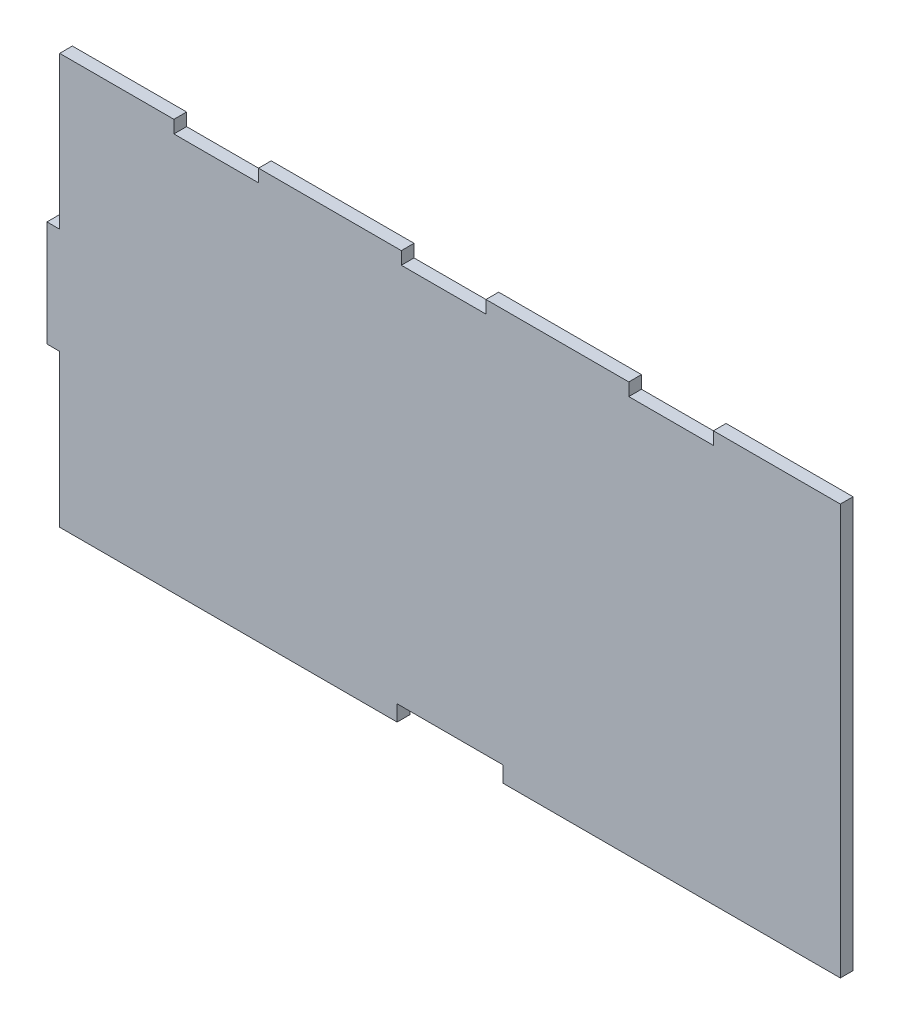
ISO-10303-21;
HEADER;
FILE_DESCRIPTION(('STEP AP214'),'2;1');
FILE_NAME('part.step','',(''),(''),'','','');
FILE_SCHEMA(('AUTOMOTIVE_DESIGN { 1 0 10303 214 1 1 1 1 }'));
ENDSEC;
DATA;
#1=APPLICATION_CONTEXT('core data for automotive mechanical design processes');
#2=APPLICATION_PROTOCOL_DEFINITION('international standard','automotive_design',2000,#1);
#3=PRODUCT_CONTEXT('',#1,'mechanical');
#4=PRODUCT('Part','Part','',(#3));
#5=PRODUCT_RELATED_PRODUCT_CATEGORY('part','',(#4));
#6=PRODUCT_DEFINITION_FORMATION('','',#4);
#7=PRODUCT_DEFINITION_CONTEXT('part definition',#1,'design');
#8=PRODUCT_DEFINITION('design','',#6,#7);
#9=PRODUCT_DEFINITION_SHAPE('','',#8);
#10=(LENGTH_UNIT() NAMED_UNIT(*) SI_UNIT(.MILLI.,.METRE.));
#11=(NAMED_UNIT(*) PLANE_ANGLE_UNIT() SI_UNIT($,.RADIAN.));
#12=(NAMED_UNIT(*) SI_UNIT($,.STERADIAN.) SOLID_ANGLE_UNIT());
#13=UNCERTAINTY_MEASURE_WITH_UNIT(LENGTH_MEASURE(1.E-05),#10,'distance_accuracy_value','');
#14=(GEOMETRIC_REPRESENTATION_CONTEXT(3) GLOBAL_UNCERTAINTY_ASSIGNED_CONTEXT((#13)) GLOBAL_UNIT_ASSIGNED_CONTEXT((#10,
#11,#12)) REPRESENTATION_CONTEXT('',''));
#15=CARTESIAN_POINT('',(0.,0.,0.));
#16=DIRECTION('',(0.,0.,1.));
#17=DIRECTION('',(1.,0.,0.));
#18=AXIS2_PLACEMENT_3D('',#15,#16,#17);
#19=CARTESIAN_POINT('',(-369.,50.,12.));
#20=DIRECTION('',(1.,0.,0.));
#21=DIRECTION('',(0.,0.,-1.));
#22=AXIS2_PLACEMENT_3D('',#19,#20,#21);
#23=PLANE('',#22);
#24=DIRECTION('',(0.,-1.,0.));
#25=VECTOR('',#24,1.);
#26=CARTESIAN_POINT('',(-369.,50.,0.));
#27=LINE('',#26,#25);
#28=CARTESIAN_POINT('',(-369.,194.,0.));
#29=VERTEX_POINT('',#28);
#30=CARTESIAN_POINT('',(-369.,50.,0.));
#31=VERTEX_POINT('',#30);
#32=EDGE_CURVE('E231',#29,#31,#27,.T.);
#33=ORIENTED_EDGE('',*,*,#32,.T.);
#34=DIRECTION('',(0.,0.,-1.));
#35=VECTOR('',#34,1.);
#36=CARTESIAN_POINT('',(-369.,50.,12.));
#37=LINE('',#36,#35);
#38=CARTESIAN_POINT('',(-369.,50.,12.));
#39=VERTEX_POINT('',#38);
#40=EDGE_CURVE('E11',#39,#31,#37,.T.);
#41=ORIENTED_EDGE('',*,*,#40,.F.);
#42=DIRECTION('',(0.,-1.,0.));
#43=VECTOR('',#42,1.);
#44=CARTESIAN_POINT('',(-369.,50.,12.));
#45=LINE('',#44,#43);
#46=CARTESIAN_POINT('',(-369.,194.,12.));
#47=VERTEX_POINT('',#46);
#48=EDGE_CURVE('E280',#47,#39,#45,.T.);
#49=ORIENTED_EDGE('',*,*,#48,.F.);
#50=DIRECTION('',(0.,0.,-1.));
#51=VECTOR('',#50,1.);
#52=CARTESIAN_POINT('',(-369.,194.,12.));
#53=LINE('',#52,#51);
#54=EDGE_CURVE('E230',#47,#29,#53,.T.);
#55=ORIENTED_EDGE('',*,*,#54,.T.);
#56=EDGE_LOOP('',(#33,#41,#49,#55));
#57=FACE_BOUND('',#56,.T.);
#58=ADVANCED_FACE('F39',(#57),#23,.F.);
#59=CARTESIAN_POINT('',(-369.,50.,12.));
#60=DIRECTION('',(0.,-1.,0.));
#61=DIRECTION('',(1.,0.,0.));
#62=AXIS2_PLACEMENT_3D('',#59,#60,#61);
#63=PLANE('',#62);
#64=DIRECTION('',(-1.,0.,0.));
#65=VECTOR('',#64,1.);
#66=CARTESIAN_POINT('',(-369.,50.,0.));
#67=LINE('',#66,#65);
#68=CARTESIAN_POINT('',(-381.,50.,0.));
#69=VERTEX_POINT('',#68);
#70=EDGE_CURVE('E233',#31,#69,#67,.T.);
#71=ORIENTED_EDGE('',*,*,#70,.T.);
#72=DIRECTION('',(0.,0.,-1.));
#73=VECTOR('',#72,1.);
#74=CARTESIAN_POINT('',(-381.,50.,12.));
#75=LINE('',#74,#73);
#76=CARTESIAN_POINT('',(-381.,50.,12.));
#77=VERTEX_POINT('',#76);
#78=EDGE_CURVE('E50',#77,#69,#75,.T.);
#79=ORIENTED_EDGE('',*,*,#78,.F.);
#80=DIRECTION('',(-1.,0.,0.));
#81=VECTOR('',#80,1.);
#82=CARTESIAN_POINT('',(-369.,50.,12.));
#83=LINE('',#82,#81);
#84=EDGE_CURVE('E147',#39,#77,#83,.T.);
#85=ORIENTED_EDGE('',*,*,#84,.F.);
#86=ORIENTED_EDGE('',*,*,#40,.T.);
#87=EDGE_LOOP('',(#71,#79,#85,#86));
#88=FACE_BOUND('',#87,.T.);
#89=ADVANCED_FACE('F414',(#88),#63,.F.);
#90=CARTESIAN_POINT('',(-381.,50.,12.));
#91=DIRECTION('',(1.,0.,0.));
#92=DIRECTION('',(0.,0.,-1.));
#93=AXIS2_PLACEMENT_3D('',#90,#91,#92);
#94=PLANE('',#93);
#95=DIRECTION('',(0.,-1.,0.));
#96=VECTOR('',#95,1.);
#97=CARTESIAN_POINT('',(-381.,50.,0.));
#98=LINE('',#97,#96);
#99=CARTESIAN_POINT('',(-381.,-50.,0.));
#100=VERTEX_POINT('',#99);
#101=EDGE_CURVE('E237',#69,#100,#98,.T.);
#102=ORIENTED_EDGE('',*,*,#101,.T.);
#103=DIRECTION('',(0.,0.,-1.));
#104=VECTOR('',#103,1.);
#105=CARTESIAN_POINT('',(-381.,-50.,12.));
#106=LINE('',#105,#104);
#107=CARTESIAN_POINT('',(-381.,-50.,12.));
#108=VERTEX_POINT('',#107);
#109=EDGE_CURVE('E334',#108,#100,#106,.T.);
#110=ORIENTED_EDGE('',*,*,#109,.F.);
#111=DIRECTION('',(0.,-1.,0.));
#112=VECTOR('',#111,1.);
#113=CARTESIAN_POINT('',(-381.,50.,12.));
#114=LINE('',#113,#112);
#115=EDGE_CURVE('E338',#77,#108,#114,.T.);
#116=ORIENTED_EDGE('',*,*,#115,.F.);
#117=ORIENTED_EDGE('',*,*,#78,.T.);
#118=EDGE_LOOP('',(#102,#110,#116,#117));
#119=FACE_BOUND('',#118,.T.);
#120=ADVANCED_FACE('F336',(#119),#94,.F.);
#121=CARTESIAN_POINT('',(-369.,-50.,12.));
#122=DIRECTION('',(0.,1.,0.));
#123=DIRECTION('',(0.,0.,1.));
#124=AXIS2_PLACEMENT_3D('',#121,#122,#123);
#125=PLANE('',#124);
#126=DIRECTION('',(1.,0.,0.));
#127=VECTOR('',#126,1.);
#128=CARTESIAN_POINT('',(-369.,-50.,0.));
#129=LINE('',#128,#127);
#130=CARTESIAN_POINT('',(-369.,-50.,0.));
#131=VERTEX_POINT('',#130);
#132=EDGE_CURVE('E239',#100,#131,#129,.T.);
#133=ORIENTED_EDGE('',*,*,#132,.T.);
#134=DIRECTION('',(0.,0.,-1.));
#135=VECTOR('',#134,1.);
#136=CARTESIAN_POINT('',(-369.,-50.,12.));
#137=LINE('',#136,#135);
#138=CARTESIAN_POINT('',(-369.,-50.,12.));
#139=VERTEX_POINT('',#138);
#140=EDGE_CURVE('E326',#139,#131,#137,.T.);
#141=ORIENTED_EDGE('',*,*,#140,.F.);
#142=DIRECTION('',(1.,0.,0.));
#143=VECTOR('',#142,1.);
#144=CARTESIAN_POINT('',(-369.,-50.,12.));
#145=LINE('',#144,#143);
#146=EDGE_CURVE('E358',#108,#139,#145,.T.);
#147=ORIENTED_EDGE('',*,*,#146,.F.);
#148=ORIENTED_EDGE('',*,*,#109,.T.);
#149=EDGE_LOOP('',(#133,#141,#147,#148));
#150=FACE_BOUND('',#149,.T.);
#151=ADVANCED_FACE('F350',(#150),#125,.F.);
#152=CARTESIAN_POINT('',(-369.,-194.,12.));
#153=DIRECTION('',(1.,0.,0.));
#154=DIRECTION('',(0.,0.,-1.));
#155=AXIS2_PLACEMENT_3D('',#152,#153,#154);
#156=PLANE('',#155);
#157=DIRECTION('',(0.,-1.,0.));
#158=VECTOR('',#157,1.);
#159=CARTESIAN_POINT('',(-369.,-194.,0.));
#160=LINE('',#159,#158);
#161=CARTESIAN_POINT('',(-369.,-194.,0.));
#162=VERTEX_POINT('',#161);
#163=EDGE_CURVE('E238',#131,#162,#160,.T.);
#164=ORIENTED_EDGE('',*,*,#163,.T.);
#165=DIRECTION('',(0.,0.,-1.));
#166=VECTOR('',#165,1.);
#167=CARTESIAN_POINT('',(-369.,-194.,12.));
#168=LINE('',#167,#166);
#169=CARTESIAN_POINT('',(-369.,-194.,12.));
#170=VERTEX_POINT('',#169);
#171=EDGE_CURVE('E327',#170,#162,#168,.T.);
#172=ORIENTED_EDGE('',*,*,#171,.F.);
#173=DIRECTION('',(0.,-1.,0.));
#174=VECTOR('',#173,1.);
#175=CARTESIAN_POINT('',(-369.,-194.,12.));
#176=LINE('',#175,#174);
#177=EDGE_CURVE('E352',#139,#170,#176,.T.);
#178=ORIENTED_EDGE('',*,*,#177,.F.);
#179=ORIENTED_EDGE('',*,*,#140,.T.);
#180=EDGE_LOOP('',(#164,#172,#178,#179));
#181=FACE_BOUND('',#180,.T.);
#182=ADVANCED_FACE('F351',(#181),#156,.F.);
#183=CARTESIAN_POINT('',(-50.0000000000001,-194.,12.));
#184=DIRECTION('',(0.,1.,0.));
#185=DIRECTION('',(-1.,0.,0.));
#186=AXIS2_PLACEMENT_3D('',#183,#184,#185);
#187=PLANE('',#186);
#188=DIRECTION('',(1.,0.,0.));
#189=VECTOR('',#188,1.);
#190=CARTESIAN_POINT('',(-50.0000000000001,-194.,0.));
#191=LINE('',#190,#189);
#192=CARTESIAN_POINT('',(-50.0000000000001,-194.,0.));
#193=VERTEX_POINT('',#192);
#194=EDGE_CURVE('E244',#162,#193,#191,.T.);
#195=ORIENTED_EDGE('',*,*,#194,.T.);
#196=DIRECTION('',(0.,0.,-1.));
#197=VECTOR('',#196,1.);
#198=CARTESIAN_POINT('',(-50.0000000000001,-194.,12.));
#199=LINE('',#198,#197);
#200=CARTESIAN_POINT('',(-50.0000000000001,-194.,12.));
#201=VERTEX_POINT('',#200);
#202=EDGE_CURVE('E322',#201,#193,#199,.T.);
#203=ORIENTED_EDGE('',*,*,#202,.F.);
#204=DIRECTION('',(1.,0.,0.));
#205=VECTOR('',#204,1.);
#206=CARTESIAN_POINT('',(-50.0000000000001,-194.,12.));
#207=LINE('',#206,#205);
#208=EDGE_CURVE('E360',#170,#201,#207,.T.);
#209=ORIENTED_EDGE('',*,*,#208,.F.);
#210=ORIENTED_EDGE('',*,*,#171,.T.);
#211=EDGE_LOOP('',(#195,#203,#209,#210));
#212=FACE_BOUND('',#211,.T.);
#213=ADVANCED_FACE('F426',(#212),#187,.F.);
#214=CARTESIAN_POINT('',(-50.0000000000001,-194.,12.));
#215=DIRECTION('',(-1.,0.,0.));
#216=DIRECTION('',(0.,-1.,0.));
#217=AXIS2_PLACEMENT_3D('',#214,#215,#216);
#218=PLANE('',#217);
#219=DIRECTION('',(0.,1.,0.));
#220=VECTOR('',#219,1.);
#221=CARTESIAN_POINT('',(-50.0000000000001,-194.,0.));
#222=LINE('',#221,#220);
#223=CARTESIAN_POINT('',(-50.,-179.,0.));
#224=VERTEX_POINT('',#223);
#225=EDGE_CURVE('E241',#193,#224,#222,.T.);
#226=ORIENTED_EDGE('',*,*,#225,.T.);
#227=DIRECTION('',(0.,0.,-1.));
#228=VECTOR('',#227,1.);
#229=CARTESIAN_POINT('',(-50.,-179.,12.));
#230=LINE('',#229,#228);
#231=CARTESIAN_POINT('',(-50.,-179.,12.));
#232=VERTEX_POINT('',#231);
#233=EDGE_CURVE('E319',#232,#224,#230,.T.);
#234=ORIENTED_EDGE('',*,*,#233,.F.);
#235=DIRECTION('',(0.,1.,0.));
#236=VECTOR('',#235,1.);
#237=CARTESIAN_POINT('',(-50.0000000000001,-194.,12.));
#238=LINE('',#237,#236);
#239=EDGE_CURVE('E359',#201,#232,#238,.T.);
#240=ORIENTED_EDGE('',*,*,#239,.F.);
#241=ORIENTED_EDGE('',*,*,#202,.T.);
#242=EDGE_LOOP('',(#226,#234,#240,#241));
#243=FACE_BOUND('',#242,.T.);
#244=ADVANCED_FACE('F432',(#243),#218,.F.);
#245=CARTESIAN_POINT('',(50.,-179.,12.));
#246=DIRECTION('',(0.,1.,0.));
#247=DIRECTION('',(0.,0.,1.));
#248=AXIS2_PLACEMENT_3D('',#245,#246,#247);
#249=PLANE('',#248);
#250=DIRECTION('',(1.,0.,0.));
#251=VECTOR('',#250,1.);
#252=CARTESIAN_POINT('',(50.,-179.,0.));
#253=LINE('',#252,#251);
#254=CARTESIAN_POINT('',(50.,-179.,0.));
#255=VERTEX_POINT('',#254);
#256=EDGE_CURVE('E247',#224,#255,#253,.T.);
#257=ORIENTED_EDGE('',*,*,#256,.T.);
#258=DIRECTION('',(0.,0.,-1.));
#259=VECTOR('',#258,1.);
#260=CARTESIAN_POINT('',(50.,-179.,12.));
#261=LINE('',#260,#259);
#262=CARTESIAN_POINT('',(50.,-179.,12.));
#263=VERTEX_POINT('',#262);
#264=EDGE_CURVE('E320',#263,#255,#261,.T.);
#265=ORIENTED_EDGE('',*,*,#264,.F.);
#266=DIRECTION('',(1.,0.,0.));
#267=VECTOR('',#266,1.);
#268=CARTESIAN_POINT('',(50.,-179.,12.));
#269=LINE('',#268,#267);
#270=EDGE_CURVE('E366',#232,#263,#269,.T.);
#271=ORIENTED_EDGE('',*,*,#270,.F.);
#272=ORIENTED_EDGE('',*,*,#233,.T.);
#273=EDGE_LOOP('',(#257,#265,#271,#272));
#274=FACE_BOUND('',#273,.T.);
#275=ADVANCED_FACE('F433',(#274),#249,.F.);
#276=CARTESIAN_POINT('',(49.9999999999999,-194.,12.));
#277=DIRECTION('',(1.,0.,0.));
#278=DIRECTION('',(0.,1.,0.));
#279=AXIS2_PLACEMENT_3D('',#276,#277,#278);
#280=PLANE('',#279);
#281=DIRECTION('',(0.,-1.,0.));
#282=VECTOR('',#281,1.);
#283=CARTESIAN_POINT('',(49.9999999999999,-194.,0.));
#284=LINE('',#283,#282);
#285=CARTESIAN_POINT('',(49.9999999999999,-194.,0.));
#286=VERTEX_POINT('',#285);
#287=EDGE_CURVE('E246',#255,#286,#284,.T.);
#288=ORIENTED_EDGE('',*,*,#287,.T.);
#289=DIRECTION('',(0.,0.,-1.));
#290=VECTOR('',#289,1.);
#291=CARTESIAN_POINT('',(49.9999999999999,-194.,12.));
#292=LINE('',#291,#290);
#293=CARTESIAN_POINT('',(49.9999999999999,-194.,12.));
#294=VERTEX_POINT('',#293);
#295=EDGE_CURVE('E312',#294,#286,#292,.T.);
#296=ORIENTED_EDGE('',*,*,#295,.F.);
#297=DIRECTION('',(0.,-1.,0.));
#298=VECTOR('',#297,1.);
#299=CARTESIAN_POINT('',(49.9999999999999,-194.,12.));
#300=LINE('',#299,#298);
#301=EDGE_CURVE('E367',#263,#294,#300,.T.);
#302=ORIENTED_EDGE('',*,*,#301,.F.);
#303=ORIENTED_EDGE('',*,*,#264,.T.);
#304=EDGE_LOOP('',(#288,#296,#302,#303));
#305=FACE_BOUND('',#304,.T.);
#306=ADVANCED_FACE('F440',(#305),#280,.F.);
#307=CARTESIAN_POINT('',(369.,-194.,12.));
#308=DIRECTION('',(0.,1.,0.));
#309=DIRECTION('',(-1.,0.,0.));
#310=AXIS2_PLACEMENT_3D('',#307,#308,#309);
#311=PLANE('',#310);
#312=DIRECTION('',(1.,0.,0.));
#313=VECTOR('',#312,1.);
#314=CARTESIAN_POINT('',(369.,-194.,0.));
#315=LINE('',#314,#313);
#316=CARTESIAN_POINT('',(369.,-194.,0.));
#317=VERTEX_POINT('',#316);
#318=EDGE_CURVE('E248',#286,#317,#315,.T.);
#319=ORIENTED_EDGE('',*,*,#318,.T.);
#320=DIRECTION('',(0.,0.,-1.));
#321=VECTOR('',#320,1.);
#322=CARTESIAN_POINT('',(369.,-194.,12.));
#323=LINE('',#322,#321);
#324=CARTESIAN_POINT('',(369.,-194.,12.));
#325=VERTEX_POINT('',#324);
#326=EDGE_CURVE('E311',#325,#317,#323,.T.);
#327=ORIENTED_EDGE('',*,*,#326,.F.);
#328=DIRECTION('',(1.,0.,0.));
#329=VECTOR('',#328,1.);
#330=CARTESIAN_POINT('',(369.,-194.,12.));
#331=LINE('',#330,#329);
#332=EDGE_CURVE('E369',#294,#325,#331,.T.);
#333=ORIENTED_EDGE('',*,*,#332,.F.);
#334=ORIENTED_EDGE('',*,*,#295,.T.);
#335=EDGE_LOOP('',(#319,#327,#333,#334));
#336=FACE_BOUND('',#335,.T.);
#337=ADVANCED_FACE('F441',(#336),#311,.F.);
#338=CARTESIAN_POINT('',(369.,-194.,12.));
#339=DIRECTION('',(-1.,0.,0.));
#340=DIRECTION('',(0.,0.,1.));
#341=AXIS2_PLACEMENT_3D('',#338,#339,#340);
#342=PLANE('',#341);
#343=DIRECTION('',(0.,1.,0.));
#344=VECTOR('',#343,1.);
#345=CARTESIAN_POINT('',(369.,-194.,0.));
#346=LINE('',#345,#344);
#347=CARTESIAN_POINT('',(369.,194.,0.));
#348=VERTEX_POINT('',#347);
#349=EDGE_CURVE('E254',#317,#348,#346,.T.);
#350=ORIENTED_EDGE('',*,*,#349,.T.);
#351=DIRECTION('',(0.,0.,-1.));
#352=VECTOR('',#351,1.);
#353=CARTESIAN_POINT('',(369.,194.,12.));
#354=LINE('',#353,#352);
#355=CARTESIAN_POINT('',(369.,194.,12.));
#356=VERTEX_POINT('',#355);
#357=EDGE_CURVE('E306',#356,#348,#354,.T.);
#358=ORIENTED_EDGE('',*,*,#357,.F.);
#359=DIRECTION('',(0.,1.,0.));
#360=VECTOR('',#359,1.);
#361=CARTESIAN_POINT('',(369.,-194.,12.));
#362=LINE('',#361,#360);
#363=EDGE_CURVE('E375',#325,#356,#362,.T.);
#364=ORIENTED_EDGE('',*,*,#363,.F.);
#365=ORIENTED_EDGE('',*,*,#326,.T.);
#366=EDGE_LOOP('',(#350,#358,#364,#365));
#367=FACE_BOUND('',#366,.T.);
#368=ADVANCED_FACE('F450',(#367),#342,.F.);
#369=CARTESIAN_POINT('',(369.,194.,12.));
#370=DIRECTION('',(0.,-1.,0.));
#371=DIRECTION('',(1.,0.,0.));
#372=AXIS2_PLACEMENT_3D('',#369,#370,#371);
#373=PLANE('',#372);
#374=DIRECTION('',(-1.,0.,0.));
#375=VECTOR('',#374,1.);
#376=CARTESIAN_POINT('',(369.,194.,0.));
#377=LINE('',#376,#375);
#378=CARTESIAN_POINT('',(249.,194.,0.));
#379=VERTEX_POINT('',#378);
#380=EDGE_CURVE('E251',#348,#379,#377,.T.);
#381=ORIENTED_EDGE('',*,*,#380,.T.);
#382=DIRECTION('',(0.,0.,-1.));
#383=VECTOR('',#382,1.);
#384=CARTESIAN_POINT('',(249.,194.,12.));
#385=LINE('',#384,#383);
#386=CARTESIAN_POINT('',(249.,194.,12.));
#387=VERTEX_POINT('',#386);
#388=EDGE_CURVE('E304',#387,#379,#385,.T.);
#389=ORIENTED_EDGE('',*,*,#388,.F.);
#390=DIRECTION('',(-1.,0.,0.));
#391=VECTOR('',#390,1.);
#392=CARTESIAN_POINT('',(369.,194.,12.));
#393=LINE('',#392,#391);
#394=EDGE_CURVE('E371',#356,#387,#393,.T.);
#395=ORIENTED_EDGE('',*,*,#394,.F.);
#396=ORIENTED_EDGE('',*,*,#357,.T.);
#397=EDGE_LOOP('',(#381,#389,#395,#396));
#398=FACE_BOUND('',#397,.T.);
#399=ADVANCED_FACE('F451',(#398),#373,.F.);
#400=CARTESIAN_POINT('',(249.,194.,12.));
#401=DIRECTION('',(1.,0.,0.));
#402=DIRECTION('',(0.,1.,0.));
#403=AXIS2_PLACEMENT_3D('',#400,#401,#402);
#404=PLANE('',#403);
#405=DIRECTION('',(0.,-1.,0.));
#406=VECTOR('',#405,1.);
#407=CARTESIAN_POINT('',(249.,194.,0.));
#408=LINE('',#407,#406);
#409=CARTESIAN_POINT('',(249.,182.,0.));
#410=VERTEX_POINT('',#409);
#411=EDGE_CURVE('E258',#379,#410,#408,.T.);
#412=ORIENTED_EDGE('',*,*,#411,.T.);
#413=DIRECTION('',(0.,0.,-1.));
#414=VECTOR('',#413,1.);
#415=CARTESIAN_POINT('',(249.,182.,12.));
#416=LINE('',#415,#414);
#417=CARTESIAN_POINT('',(249.,182.,12.));
#418=VERTEX_POINT('',#417);
#419=EDGE_CURVE('E302',#418,#410,#416,.T.);
#420=ORIENTED_EDGE('',*,*,#419,.F.);
#421=DIRECTION('',(0.,-1.,0.));
#422=VECTOR('',#421,1.);
#423=CARTESIAN_POINT('',(249.,194.,12.));
#424=LINE('',#423,#422);
#425=EDGE_CURVE('E377',#387,#418,#424,.T.);
#426=ORIENTED_EDGE('',*,*,#425,.F.);
#427=ORIENTED_EDGE('',*,*,#388,.T.);
#428=EDGE_LOOP('',(#412,#420,#426,#427));
#429=FACE_BOUND('',#428,.T.);
#430=ADVANCED_FACE('F454',(#429),#404,.F.);
#431=CARTESIAN_POINT('',(169.,182.,12.));
#432=DIRECTION('',(0.,-1.,0.));
#433=DIRECTION('',(0.,0.,-1.));
#434=AXIS2_PLACEMENT_3D('',#431,#432,#433);
#435=PLANE('',#434);
#436=DIRECTION('',(-1.,0.,0.));
#437=VECTOR('',#436,1.);
#438=CARTESIAN_POINT('',(169.,182.,0.));
#439=LINE('',#438,#437);
#440=CARTESIAN_POINT('',(169.,182.,0.));
#441=VERTEX_POINT('',#440);
#442=EDGE_CURVE('E256',#410,#441,#439,.T.);
#443=ORIENTED_EDGE('',*,*,#442,.T.);
#444=DIRECTION('',(0.,0.,-1.));
#445=VECTOR('',#444,1.);
#446=CARTESIAN_POINT('',(169.,182.,12.));
#447=LINE('',#446,#445);
#448=CARTESIAN_POINT('',(169.,182.,12.));
#449=VERTEX_POINT('',#448);
#450=EDGE_CURVE('E296',#449,#441,#447,.T.);
#451=ORIENTED_EDGE('',*,*,#450,.F.);
#452=DIRECTION('',(-1.,0.,0.));
#453=VECTOR('',#452,1.);
#454=CARTESIAN_POINT('',(169.,182.,12.));
#455=LINE('',#454,#453);
#456=EDGE_CURVE('E380',#418,#449,#455,.T.);
#457=ORIENTED_EDGE('',*,*,#456,.F.);
#458=ORIENTED_EDGE('',*,*,#419,.T.);
#459=EDGE_LOOP('',(#443,#451,#457,#458));
#460=FACE_BOUND('',#459,.T.);
#461=ADVANCED_FACE('F458',(#460),#435,.F.);
#462=CARTESIAN_POINT('',(169.,194.,12.));
#463=DIRECTION('',(-1.,0.,0.));
#464=DIRECTION('',(0.,0.,1.));
#465=AXIS2_PLACEMENT_3D('',#462,#463,#464);
#466=PLANE('',#465);
#467=DIRECTION('',(0.,1.,0.));
#468=VECTOR('',#467,1.);
#469=CARTESIAN_POINT('',(169.,194.,0.));
#470=LINE('',#469,#468);
#471=CARTESIAN_POINT('',(169.,194.,0.));
#472=VERTEX_POINT('',#471);
#473=EDGE_CURVE('E259',#441,#472,#470,.T.);
#474=ORIENTED_EDGE('',*,*,#473,.T.);
#475=DIRECTION('',(0.,0.,-1.));
#476=VECTOR('',#475,1.);
#477=CARTESIAN_POINT('',(169.,194.,12.));
#478=LINE('',#477,#476);
#479=CARTESIAN_POINT('',(169.,194.,12.));
#480=VERTEX_POINT('',#479);
#481=EDGE_CURVE('E297',#480,#472,#478,.T.);
#482=ORIENTED_EDGE('',*,*,#481,.F.);
#483=DIRECTION('',(0.,1.,0.));
#484=VECTOR('',#483,1.);
#485=CARTESIAN_POINT('',(169.,194.,12.));
#486=LINE('',#485,#484);
#487=EDGE_CURVE('E378',#449,#480,#486,.T.);
#488=ORIENTED_EDGE('',*,*,#487,.F.);
#489=ORIENTED_EDGE('',*,*,#450,.T.);
#490=EDGE_LOOP('',(#474,#482,#488,#489));
#491=FACE_BOUND('',#490,.T.);
#492=ADVANCED_FACE('F464',(#491),#466,.F.);
#493=CARTESIAN_POINT('',(169.,194.,12.));
#494=DIRECTION('',(0.,-1.,0.));
#495=DIRECTION('',(1.,0.,0.));
#496=AXIS2_PLACEMENT_3D('',#493,#494,#495);
#497=PLANE('',#496);
#498=DIRECTION('',(-1.,0.,0.));
#499=VECTOR('',#498,1.);
#500=CARTESIAN_POINT('',(169.,194.,0.));
#501=LINE('',#500,#499);
#502=CARTESIAN_POINT('',(33.9999999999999,194.,0.));
#503=VERTEX_POINT('',#502);
#504=EDGE_CURVE('E265',#472,#503,#501,.T.);
#505=ORIENTED_EDGE('',*,*,#504,.T.);
#506=DIRECTION('',(0.,0.,-1.));
#507=VECTOR('',#506,1.);
#508=CARTESIAN_POINT('',(33.9999999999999,194.,12.));
#509=LINE('',#508,#507);
#510=CARTESIAN_POINT('',(33.9999999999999,194.,12.));
#511=VERTEX_POINT('',#510);
#512=EDGE_CURVE('E291',#511,#503,#509,.T.);
#513=ORIENTED_EDGE('',*,*,#512,.F.);
#514=DIRECTION('',(-1.,0.,0.));
#515=VECTOR('',#514,1.);
#516=CARTESIAN_POINT('',(169.,194.,12.));
#517=LINE('',#516,#515);
#518=EDGE_CURVE('E385',#480,#511,#517,.T.);
#519=ORIENTED_EDGE('',*,*,#518,.F.);
#520=ORIENTED_EDGE('',*,*,#481,.T.);
#521=EDGE_LOOP('',(#505,#513,#519,#520));
#522=FACE_BOUND('',#521,.T.);
#523=ADVANCED_FACE('F469',(#522),#497,.F.);
#524=CARTESIAN_POINT('',(33.9999999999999,194.,12.));
#525=DIRECTION('',(1.,0.,0.));
#526=DIRECTION('',(0.,0.,-1.));
#527=AXIS2_PLACEMENT_3D('',#524,#525,#526);
#528=PLANE('',#527);
#529=DIRECTION('',(0.,-1.,0.));
#530=VECTOR('',#529,1.);
#531=CARTESIAN_POINT('',(33.9999999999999,194.,0.));
#532=LINE('',#531,#530);
#533=CARTESIAN_POINT('',(33.9999999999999,182.,0.));
#534=VERTEX_POINT('',#533);
#535=EDGE_CURVE('E264',#503,#534,#532,.T.);
#536=ORIENTED_EDGE('',*,*,#535,.T.);
#537=DIRECTION('',(0.,0.,-1.));
#538=VECTOR('',#537,1.);
#539=CARTESIAN_POINT('',(33.9999999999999,182.,12.));
#540=LINE('',#539,#538);
#541=CARTESIAN_POINT('',(33.9999999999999,182.,12.));
#542=VERTEX_POINT('',#541);
#543=EDGE_CURVE('E288',#542,#534,#540,.T.);
#544=ORIENTED_EDGE('',*,*,#543,.F.);
#545=DIRECTION('',(0.,-1.,0.));
#546=VECTOR('',#545,1.);
#547=CARTESIAN_POINT('',(33.9999999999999,194.,12.));
#548=LINE('',#547,#546);
#549=EDGE_CURVE('E384',#511,#542,#548,.T.);
#550=ORIENTED_EDGE('',*,*,#549,.F.);
#551=ORIENTED_EDGE('',*,*,#512,.T.);
#552=EDGE_LOOP('',(#536,#544,#550,#551));
#553=FACE_BOUND('',#552,.T.);
#554=ADVANCED_FACE('F472',(#553),#528,.F.);
#555=CARTESIAN_POINT('',(-46.0000000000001,182.,12.));
#556=DIRECTION('',(0.,-1.,0.));
#557=DIRECTION('',(0.,0.,-1.));
#558=AXIS2_PLACEMENT_3D('',#555,#556,#557);
#559=PLANE('',#558);
#560=DIRECTION('',(-1.,0.,0.));
#561=VECTOR('',#560,1.);
#562=CARTESIAN_POINT('',(-46.0000000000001,182.,0.));
#563=LINE('',#562,#561);
#564=CARTESIAN_POINT('',(-46.0000000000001,182.,0.));
#565=VERTEX_POINT('',#564);
#566=EDGE_CURVE('E266',#534,#565,#563,.T.);
#567=ORIENTED_EDGE('',*,*,#566,.T.);
#568=DIRECTION('',(0.,0.,-1.));
#569=VECTOR('',#568,1.);
#570=CARTESIAN_POINT('',(-46.0000000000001,182.,12.));
#571=LINE('',#570,#569);
#572=CARTESIAN_POINT('',(-46.0000000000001,182.,12.));
#573=VERTEX_POINT('',#572);
#574=EDGE_CURVE('E289',#573,#565,#571,.T.);
#575=ORIENTED_EDGE('',*,*,#574,.F.);
#576=DIRECTION('',(-1.,0.,0.));
#577=VECTOR('',#576,1.);
#578=CARTESIAN_POINT('',(-46.0000000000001,182.,12.));
#579=LINE('',#578,#577);
#580=EDGE_CURVE('E387',#542,#573,#579,.T.);
#581=ORIENTED_EDGE('',*,*,#580,.F.);
#582=ORIENTED_EDGE('',*,*,#543,.T.);
#583=EDGE_LOOP('',(#567,#575,#581,#582));
#584=FACE_BOUND('',#583,.T.);
#585=ADVANCED_FACE('F473',(#584),#559,.F.);
#586=CARTESIAN_POINT('',(-46.0000000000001,194.,12.));
#587=DIRECTION('',(-1.,0.,0.));
#588=DIRECTION('',(0.,0.,1.));
#589=AXIS2_PLACEMENT_3D('',#586,#587,#588);
#590=PLANE('',#589);
#591=DIRECTION('',(0.,1.,0.));
#592=VECTOR('',#591,1.);
#593=CARTESIAN_POINT('',(-46.0000000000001,194.,0.));
#594=LINE('',#593,#592);
#595=CARTESIAN_POINT('',(-46.0000000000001,194.,0.));
#596=VERTEX_POINT('',#595);
#597=EDGE_CURVE('E268',#565,#596,#594,.T.);
#598=ORIENTED_EDGE('',*,*,#597,.T.);
#599=DIRECTION('',(0.,0.,-1.));
#600=VECTOR('',#599,1.);
#601=CARTESIAN_POINT('',(-46.0000000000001,194.,12.));
#602=LINE('',#601,#600);
#603=CARTESIAN_POINT('',(-46.0000000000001,194.,12.));
#604=VERTEX_POINT('',#603);
#605=EDGE_CURVE('E281',#604,#596,#602,.T.);
#606=ORIENTED_EDGE('',*,*,#605,.F.);
#607=DIRECTION('',(0.,1.,0.));
#608=VECTOR('',#607,1.);
#609=CARTESIAN_POINT('',(-46.0000000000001,194.,12.));
#610=LINE('',#609,#608);
#611=EDGE_CURVE('E390',#573,#604,#610,.T.);
#612=ORIENTED_EDGE('',*,*,#611,.F.);
#613=ORIENTED_EDGE('',*,*,#574,.T.);
#614=EDGE_LOOP('',(#598,#606,#612,#613));
#615=FACE_BOUND('',#614,.T.);
#616=ADVANCED_FACE('F476',(#615),#590,.F.);
#617=CARTESIAN_POINT('',(-46.0000000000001,194.,12.));
#618=DIRECTION('',(0.,-1.,0.));
#619=DIRECTION('',(1.,0.,0.));
#620=AXIS2_PLACEMENT_3D('',#617,#618,#619);
#621=PLANE('',#620);
#622=DIRECTION('',(-1.,0.,0.));
#623=VECTOR('',#622,1.);
#624=CARTESIAN_POINT('',(-46.0000000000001,194.,0.));
#625=LINE('',#624,#623);
#626=CARTESIAN_POINT('',(-181.,194.,0.));
#627=VERTEX_POINT('',#626);
#628=EDGE_CURVE('E269',#596,#627,#625,.T.);
#629=ORIENTED_EDGE('',*,*,#628,.T.);
#630=DIRECTION('',(0.,0.,-1.));
#631=VECTOR('',#630,1.);
#632=CARTESIAN_POINT('',(-181.,194.,12.));
#633=LINE('',#632,#631);
#634=CARTESIAN_POINT('',(-181.,194.,12.));
#635=VERTEX_POINT('',#634);
#636=EDGE_CURVE('E282',#635,#627,#633,.T.);
#637=ORIENTED_EDGE('',*,*,#636,.F.);
#638=DIRECTION('',(-1.,0.,0.));
#639=VECTOR('',#638,1.);
#640=CARTESIAN_POINT('',(-46.0000000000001,194.,12.));
#641=LINE('',#640,#639);
#642=EDGE_CURVE('E388',#604,#635,#641,.T.);
#643=ORIENTED_EDGE('',*,*,#642,.F.);
#644=ORIENTED_EDGE('',*,*,#605,.T.);
#645=EDGE_LOOP('',(#629,#637,#643,#644));
#646=FACE_BOUND('',#645,.T.);
#647=ADVANCED_FACE('F398',(#646),#621,.F.);
#648=CARTESIAN_POINT('',(-181.,194.,12.));
#649=DIRECTION('',(1.,0.,0.));
#650=DIRECTION('',(0.,1.,0.));
#651=AXIS2_PLACEMENT_3D('',#648,#649,#650);
#652=PLANE('',#651);
#653=DIRECTION('',(0.,-1.,0.));
#654=VECTOR('',#653,1.);
#655=CARTESIAN_POINT('',(-181.,194.,0.));
#656=LINE('',#655,#654);
#657=CARTESIAN_POINT('',(-181.,182.,0.));
#658=VERTEX_POINT('',#657);
#659=EDGE_CURVE('E275',#627,#658,#656,.T.);
#660=ORIENTED_EDGE('',*,*,#659,.T.);
#661=DIRECTION('',(0.,0.,-1.));
#662=VECTOR('',#661,1.);
#663=CARTESIAN_POINT('',(-181.,182.,12.));
#664=LINE('',#663,#662);
#665=CARTESIAN_POINT('',(-181.,182.,12.));
#666=VERTEX_POINT('',#665);
#667=EDGE_CURVE('E225',#666,#658,#664,.T.);
#668=ORIENTED_EDGE('',*,*,#667,.F.);
#669=DIRECTION('',(0.,-1.,0.));
#670=VECTOR('',#669,1.);
#671=CARTESIAN_POINT('',(-181.,194.,12.));
#672=LINE('',#671,#670);
#673=EDGE_CURVE('E211',#635,#666,#672,.T.);
#674=ORIENTED_EDGE('',*,*,#673,.F.);
#675=ORIENTED_EDGE('',*,*,#636,.T.);
#676=EDGE_LOOP('',(#660,#668,#674,#675));
#677=FACE_BOUND('',#676,.T.);
#678=ADVANCED_FACE('F397',(#677),#652,.F.);
#679=CARTESIAN_POINT('',(-261.,182.,12.));
#680=DIRECTION('',(0.,-1.,0.));
#681=DIRECTION('',(0.,0.,-1.));
#682=AXIS2_PLACEMENT_3D('',#679,#680,#681);
#683=PLANE('',#682);
#684=DIRECTION('',(-1.,0.,0.));
#685=VECTOR('',#684,1.);
#686=CARTESIAN_POINT('',(-261.,182.,0.));
#687=LINE('',#686,#685);
#688=CARTESIAN_POINT('',(-261.,182.,0.));
#689=VERTEX_POINT('',#688);
#690=EDGE_CURVE('E221',#658,#689,#687,.T.);
#691=ORIENTED_EDGE('',*,*,#690,.T.);
#692=DIRECTION('',(0.,0.,-1.));
#693=VECTOR('',#692,1.);
#694=CARTESIAN_POINT('',(-261.,182.,12.));
#695=LINE('',#694,#693);
#696=CARTESIAN_POINT('',(-261.,182.,12.));
#697=VERTEX_POINT('',#696);
#698=EDGE_CURVE('E216',#697,#689,#695,.T.);
#699=ORIENTED_EDGE('',*,*,#698,.F.);
#700=DIRECTION('',(-1.,0.,0.));
#701=VECTOR('',#700,1.);
#702=CARTESIAN_POINT('',(-261.,182.,12.));
#703=LINE('',#702,#701);
#704=EDGE_CURVE('E209',#666,#697,#703,.T.);
#705=ORIENTED_EDGE('',*,*,#704,.F.);
#706=ORIENTED_EDGE('',*,*,#667,.T.);
#707=EDGE_LOOP('',(#691,#699,#705,#706));
#708=FACE_BOUND('',#707,.T.);
#709=ADVANCED_FACE('F219',(#708),#683,.F.);
#710=CARTESIAN_POINT('',(-261.,194.,12.));
#711=DIRECTION('',(-1.,0.,0.));
#712=DIRECTION('',(0.,0.,1.));
#713=AXIS2_PLACEMENT_3D('',#710,#711,#712);
#714=PLANE('',#713);
#715=DIRECTION('',(0.,1.,0.));
#716=VECTOR('',#715,1.);
#717=CARTESIAN_POINT('',(-261.,194.,0.));
#718=LINE('',#717,#716);
#719=CARTESIAN_POINT('',(-261.,194.,0.));
#720=VERTEX_POINT('',#719);
#721=EDGE_CURVE('E135',#689,#720,#718,.T.);
#722=ORIENTED_EDGE('',*,*,#721,.T.);
#723=DIRECTION('',(0.,0.,-1.));
#724=VECTOR('',#723,1.);
#725=CARTESIAN_POINT('',(-261.,194.,12.));
#726=LINE('',#725,#724);
#727=CARTESIAN_POINT('',(-261.,194.,12.));
#728=VERTEX_POINT('',#727);
#729=EDGE_CURVE('E223',#728,#720,#726,.T.);
#730=ORIENTED_EDGE('',*,*,#729,.F.);
#731=DIRECTION('',(0.,1.,0.));
#732=VECTOR('',#731,1.);
#733=CARTESIAN_POINT('',(-261.,194.,12.));
#734=LINE('',#733,#732);
#735=EDGE_CURVE('E213',#697,#728,#734,.T.);
#736=ORIENTED_EDGE('',*,*,#735,.F.);
#737=ORIENTED_EDGE('',*,*,#698,.T.);
#738=EDGE_LOOP('',(#722,#730,#736,#737));
#739=FACE_BOUND('',#738,.T.);
#740=ADVANCED_FACE('F224',(#739),#714,.F.);
#741=CARTESIAN_POINT('',(-261.,194.,12.));
#742=DIRECTION('',(0.,-1.,0.));
#743=DIRECTION('',(1.,0.,0.));
#744=AXIS2_PLACEMENT_3D('',#741,#742,#743);
#745=PLANE('',#744);
#746=DIRECTION('',(-1.,0.,0.));
#747=VECTOR('',#746,1.);
#748=CARTESIAN_POINT('',(-261.,194.,0.));
#749=LINE('',#748,#747);
#750=EDGE_CURVE('E138',#720,#29,#749,.T.);
#751=ORIENTED_EDGE('',*,*,#750,.T.);
#752=ORIENTED_EDGE('',*,*,#54,.F.);
#753=DIRECTION('',(-1.,0.,0.));
#754=VECTOR('',#753,1.);
#755=CARTESIAN_POINT('',(-261.,194.,12.));
#756=LINE('',#755,#754);
#757=EDGE_CURVE('E54',#728,#47,#756,.T.);
#758=ORIENTED_EDGE('',*,*,#757,.F.);
#759=ORIENTED_EDGE('',*,*,#729,.T.);
#760=EDGE_LOOP('',(#751,#752,#758,#759));
#761=FACE_BOUND('',#760,.T.);
#762=ADVANCED_FACE('F402',(#761),#745,.F.);
#763=CARTESIAN_POINT('',(0.,0.,12.));
#764=DIRECTION('',(0.,0.,1.));
#765=DIRECTION('',(1.,0.,0.));
#766=AXIS2_PLACEMENT_3D('',#763,#764,#765);
#767=PLANE('',#766);
#768=ORIENTED_EDGE('',*,*,#48,.T.);
#769=ORIENTED_EDGE('',*,*,#84,.T.);
#770=ORIENTED_EDGE('',*,*,#115,.T.);
#771=ORIENTED_EDGE('',*,*,#146,.T.);
#772=ORIENTED_EDGE('',*,*,#177,.T.);
#773=ORIENTED_EDGE('',*,*,#208,.T.);
#774=ORIENTED_EDGE('',*,*,#239,.T.);
#775=ORIENTED_EDGE('',*,*,#270,.T.);
#776=ORIENTED_EDGE('',*,*,#301,.T.);
#777=ORIENTED_EDGE('',*,*,#332,.T.);
#778=ORIENTED_EDGE('',*,*,#363,.T.);
#779=ORIENTED_EDGE('',*,*,#394,.T.);
#780=ORIENTED_EDGE('',*,*,#425,.T.);
#781=ORIENTED_EDGE('',*,*,#456,.T.);
#782=ORIENTED_EDGE('',*,*,#487,.T.);
#783=ORIENTED_EDGE('',*,*,#518,.T.);
#784=ORIENTED_EDGE('',*,*,#549,.T.);
#785=ORIENTED_EDGE('',*,*,#580,.T.);
#786=ORIENTED_EDGE('',*,*,#611,.T.);
#787=ORIENTED_EDGE('',*,*,#642,.T.);
#788=ORIENTED_EDGE('',*,*,#673,.T.);
#789=ORIENTED_EDGE('',*,*,#704,.T.);
#790=ORIENTED_EDGE('',*,*,#735,.T.);
#791=ORIENTED_EDGE('',*,*,#757,.T.);
#792=EDGE_LOOP('',(#768,#769,#770,#771,#772,#773,#774,#775,#776,#777,#778,#779,#780,#781,#782,
#783,#784,#785,#786,#787,#788,#789,#790,#791));
#793=FACE_BOUND('',#792,.T.);
#794=ADVANCED_FACE('F206',(#793),#767,.T.);
#795=CARTESIAN_POINT('',(0.,0.,0.));
#796=DIRECTION('',(0.,0.,1.));
#797=DIRECTION('',(1.,0.,0.));
#798=AXIS2_PLACEMENT_3D('',#795,#796,#797);
#799=PLANE('',#798);
#800=ORIENTED_EDGE('',*,*,#32,.F.);
#801=ORIENTED_EDGE('',*,*,#750,.F.);
#802=ORIENTED_EDGE('',*,*,#721,.F.);
#803=ORIENTED_EDGE('',*,*,#690,.F.);
#804=ORIENTED_EDGE('',*,*,#659,.F.);
#805=ORIENTED_EDGE('',*,*,#628,.F.);
#806=ORIENTED_EDGE('',*,*,#597,.F.);
#807=ORIENTED_EDGE('',*,*,#566,.F.);
#808=ORIENTED_EDGE('',*,*,#535,.F.);
#809=ORIENTED_EDGE('',*,*,#504,.F.);
#810=ORIENTED_EDGE('',*,*,#473,.F.);
#811=ORIENTED_EDGE('',*,*,#442,.F.);
#812=ORIENTED_EDGE('',*,*,#411,.F.);
#813=ORIENTED_EDGE('',*,*,#380,.F.);
#814=ORIENTED_EDGE('',*,*,#349,.F.);
#815=ORIENTED_EDGE('',*,*,#318,.F.);
#816=ORIENTED_EDGE('',*,*,#287,.F.);
#817=ORIENTED_EDGE('',*,*,#256,.F.);
#818=ORIENTED_EDGE('',*,*,#225,.F.);
#819=ORIENTED_EDGE('',*,*,#194,.F.);
#820=ORIENTED_EDGE('',*,*,#163,.F.);
#821=ORIENTED_EDGE('',*,*,#132,.F.);
#822=ORIENTED_EDGE('',*,*,#101,.F.);
#823=ORIENTED_EDGE('',*,*,#70,.F.);
#824=EDGE_LOOP('',(#800,#801,#802,#803,#804,#805,#806,#807,#808,#809,#810,#811,#812,#813,#814,
#815,#816,#817,#818,#819,#820,#821,#822,#823));
#825=FACE_BOUND('',#824,.T.);
#826=ADVANCED_FACE('F341',(#825),#799,.F.);
#827=CLOSED_SHELL('',(#58,#89,#120,#151,#182,#213,#244,#275,#306,#337,#368,#399,#430,#461,#492,
#523,#554,#585,#616,#647,#678,#709,#740,#762,#794,#826));
#828=MANIFOLD_SOLID_BREP('B2',#827);
#829=ADVANCED_BREP_SHAPE_REPRESENTATION('',(#18,#828),#14);
#830=SHAPE_DEFINITION_REPRESENTATION(#9,#829);
ENDSEC;
END-ISO-10303-21;
